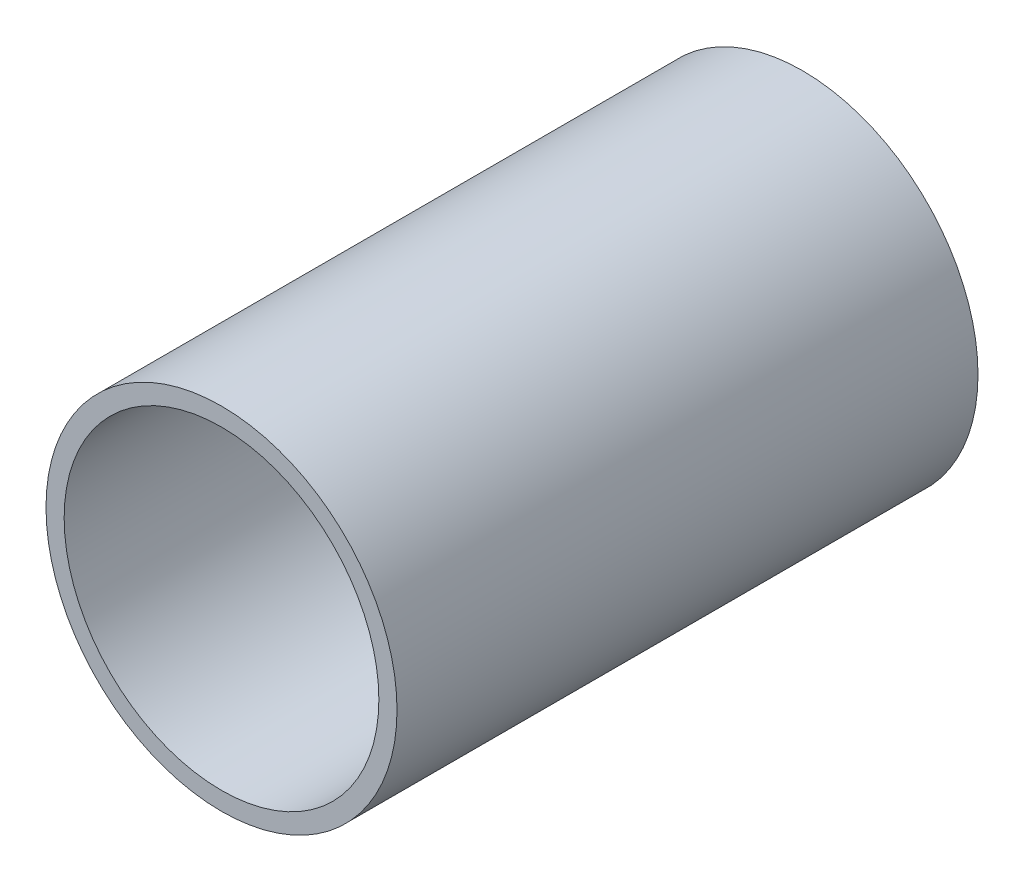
ISO-10303-21;
HEADER;
FILE_DESCRIPTION(('STEP AP214'),'2;1');
FILE_NAME('part.step','',(''),(''),'','','');
FILE_SCHEMA(('AUTOMOTIVE_DESIGN { 1 0 10303 214 1 1 1 1 }'));
ENDSEC;
DATA;
#1=APPLICATION_CONTEXT('core data for automotive mechanical design processes');
#2=APPLICATION_PROTOCOL_DEFINITION('international standard','automotive_design',2000,#1);
#3=PRODUCT_CONTEXT('',#1,'mechanical');
#4=PRODUCT('Part','Part','',(#3));
#5=PRODUCT_RELATED_PRODUCT_CATEGORY('part','',(#4));
#6=PRODUCT_DEFINITION_FORMATION('','',#4);
#7=PRODUCT_DEFINITION_CONTEXT('part definition',#1,'design');
#8=PRODUCT_DEFINITION('design','',#6,#7);
#9=PRODUCT_DEFINITION_SHAPE('','',#8);
#10=(LENGTH_UNIT() NAMED_UNIT(*) SI_UNIT(.MILLI.,.METRE.));
#11=(NAMED_UNIT(*) PLANE_ANGLE_UNIT() SI_UNIT($,.RADIAN.));
#12=(NAMED_UNIT(*) SI_UNIT($,.STERADIAN.) SOLID_ANGLE_UNIT());
#13=UNCERTAINTY_MEASURE_WITH_UNIT(LENGTH_MEASURE(1.E-05),#10,'distance_accuracy_value','');
#14=(GEOMETRIC_REPRESENTATION_CONTEXT(3) GLOBAL_UNCERTAINTY_ASSIGNED_CONTEXT((#13)) GLOBAL_UNIT_ASSIGNED_CONTEXT((#10,
#11,#12)) REPRESENTATION_CONTEXT('',''));
#15=CARTESIAN_POINT('',(0.,0.,0.));
#16=DIRECTION('',(0.,0.,1.));
#17=DIRECTION('',(1.,0.,0.));
#18=AXIS2_PLACEMENT_3D('',#15,#16,#17);
#19=CARTESIAN_POINT('',(0.,0.,48.));
#20=DIRECTION('',(0.,0.,1.));
#21=DIRECTION('',(1.,0.,0.));
#22=AXIS2_PLACEMENT_3D('',#19,#20,#21);
#23=PLANE('',#22);
#24=CARTESIAN_POINT('',(0.,0.,48.));
#25=DIRECTION('',(0.,0.,1.));
#26=DIRECTION('',(1.,0.,0.));
#27=AXIS2_PLACEMENT_3D('',#24,#25,#26);
#28=CIRCLE('',#27,14.5);
#29=CARTESIAN_POINT('',(14.5,0.,48.));
#30=VERTEX_POINT('',#29);
#31=EDGE_CURVE('E10',#30,#30,#28,.T.);
#32=ORIENTED_EDGE('',*,*,#31,.T.);
#33=EDGE_LOOP('',(#32));
#34=FACE_BOUND('',#33,.T.);
#35=CARTESIAN_POINT('',(0.,0.,48.));
#36=DIRECTION('',(0.,0.,1.));
#37=DIRECTION('',(1.,0.,0.));
#38=AXIS2_PLACEMENT_3D('',#35,#36,#37);
#39=CIRCLE('',#38,13.);
#40=CARTESIAN_POINT('',(13.,0.,48.));
#41=VERTEX_POINT('',#40);
#42=EDGE_CURVE('E35',#41,#41,#39,.T.);
#43=ORIENTED_EDGE('',*,*,#42,.F.);
#44=EDGE_LOOP('',(#43));
#45=FACE_BOUND('',#44,.T.);
#46=ADVANCED_FACE('F24',(#34,#45),#23,.T.);
#47=CARTESIAN_POINT('',(0.,0.,0.));
#48=DIRECTION('',(0.,0.,1.));
#49=DIRECTION('',(1.,0.,0.));
#50=AXIS2_PLACEMENT_3D('',#47,#48,#49);
#51=PLANE('',#50);
#52=CARTESIAN_POINT('',(0.,0.,0.));
#53=DIRECTION('',(0.,0.,1.));
#54=DIRECTION('',(1.,0.,0.));
#55=AXIS2_PLACEMENT_3D('',#52,#53,#54);
#56=CIRCLE('',#55,14.5);
#57=CARTESIAN_POINT('',(14.5,0.,0.));
#58=VERTEX_POINT('',#57);
#59=EDGE_CURVE('E31',#58,#58,#56,.T.);
#60=ORIENTED_EDGE('',*,*,#59,.F.);
#61=EDGE_LOOP('',(#60));
#62=FACE_BOUND('',#61,.T.);
#63=CARTESIAN_POINT('',(0.,0.,0.));
#64=DIRECTION('',(0.,0.,1.));
#65=DIRECTION('',(1.,0.,0.));
#66=AXIS2_PLACEMENT_3D('',#63,#64,#65);
#67=CIRCLE('',#66,13.);
#68=CARTESIAN_POINT('',(13.,0.,0.));
#69=VERTEX_POINT('',#68);
#70=EDGE_CURVE('E39',#69,#69,#67,.T.);
#71=ORIENTED_EDGE('',*,*,#70,.T.);
#72=EDGE_LOOP('',(#71));
#73=FACE_BOUND('',#72,.T.);
#74=ADVANCED_FACE('F45',(#62,#73),#51,.F.);
#75=CARTESIAN_POINT('',(0.,0.,48.));
#76=DIRECTION('',(0.,0.,-1.));
#77=DIRECTION('',(-1.,0.,0.));
#78=AXIS2_PLACEMENT_3D('',#75,#76,#77);
#79=CYLINDRICAL_SURFACE('',#78,14.5);
#80=ORIENTED_EDGE('',*,*,#31,.F.);
#81=EDGE_LOOP('',(#80));
#82=FACE_BOUND('',#81,.T.);
#83=ORIENTED_EDGE('',*,*,#59,.T.);
#84=EDGE_LOOP('',(#83));
#85=FACE_BOUND('',#84,.T.);
#86=ADVANCED_FACE('F26',(#82,#85),#79,.T.);
#87=CARTESIAN_POINT('',(0.,0.,48.));
#88=DIRECTION('',(0.,0.,-1.));
#89=DIRECTION('',(-1.,0.,0.));
#90=AXIS2_PLACEMENT_3D('',#87,#88,#89);
#91=CYLINDRICAL_SURFACE('',#90,13.);
#92=ORIENTED_EDGE('',*,*,#42,.T.);
#93=EDGE_LOOP('',(#92));
#94=FACE_BOUND('',#93,.T.);
#95=ORIENTED_EDGE('',*,*,#70,.F.);
#96=EDGE_LOOP('',(#95));
#97=FACE_BOUND('',#96,.T.);
#98=ADVANCED_FACE('F47',(#94,#97),#91,.F.);
#99=CLOSED_SHELL('',(#46,#74,#86,#98));
#100=MANIFOLD_SOLID_BREP('B2',#99);
#101=ADVANCED_BREP_SHAPE_REPRESENTATION('',(#18,#100),#14);
#102=SHAPE_DEFINITION_REPRESENTATION(#9,#101);
ENDSEC;
END-ISO-10303-21;
